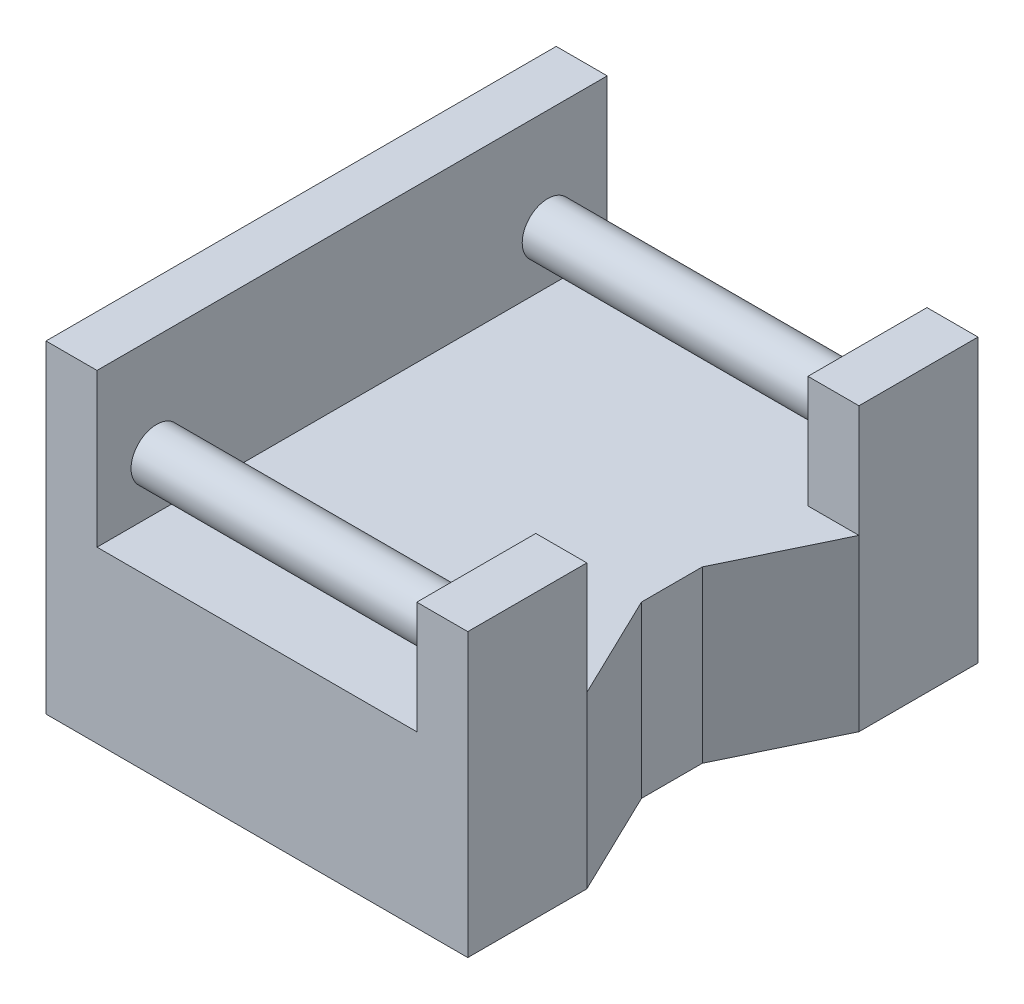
from build123d import *

# Parameters (mm, degrees)
ESTRUSIONE_ESTRUSIONE2_DEPTH = 5
SCHIZZO4_W                   = 1.5
SCHIZZO4_H                   = 15
ESTRUSIONE_ESTRUSIONE4_DEPTH = 4.5
SCHIZZO5_W                   = 1.5
SCHIZZO5_H                   = 3.5
ESTRUSIONE_ESTRUSIONE5_DEPTH = 3.3
SCHIZZO7_R                   = 0.75
ESTRUSIONE_ESTRUSIONE6_DEPTH = 10
SCALA2_SCALE                 = 10


with BuildPart() as part:
    # Schizzo1 → Estrusione-Estrusione2 (new body)
    with BuildSketch(Plane(origin=(0, 0, 0), x_dir=(1, 0, 0), z_dir=(0, 1, 0))):
        Polygon((0, 0), (0, 15), (12.4, 15), (12.4, 11.5), (10.9, 8.39340669), (10.9, 6.60659331), (12.4, 3.5), (12.4, 0), align=None)
    extrude(amount=ESTRUSIONE_ESTRUSIONE2_DEPTH)

    # Schizzo4 → Estrusione-Estrusione4 (add)
    with BuildSketch(Plane(origin=(0, 5, 0), x_dir=(1, 0, 0), z_dir=(0, 1, 0))):
        with Locations((0.75, 7.5)):
            Rectangle(SCHIZZO4_W, SCHIZZO4_H)
    extrude(amount=ESTRUSIONE_ESTRUSIONE4_DEPTH)

    # Schizzo5 → Estrusione-Estrusione5 (add)
    with BuildSketch(Plane(origin=(0, 5, 0), x_dir=(1, 0, 0), z_dir=(0, 1, 0))):
        with Locations((11.65, 1.75)):
            Rectangle(SCHIZZO5_W, SCHIZZO5_H)
        with Locations((11.65, 13.25)):
            Rectangle(SCHIZZO5_W, SCHIZZO5_H)
    extrude(amount=ESTRUSIONE_ESTRUSIONE5_DEPTH)

    # Schizzo7 → Estrusione-Estrusione6 (add)
    with BuildSketch(Plane.ZY.offset(-10.9)):
        with Locations(Location((-1.75, 6.5, 0), (0, 0, 180))):
            Circle(SCHIZZO7_R)
        with Locations(Location((-13.25, 6.5, 0), (0, 0, 180))):
            Circle(SCHIZZO7_R)
    extrude(amount=ESTRUSIONE_ESTRUSIONE6_DEPTH)


with BuildPart() as part_1:
    # Scala2: scaled about (5.66460731, 3.21311072, -7.5)
    add(part.part.scale(SCALA2_SCALE).moved(Location((-50.98146579, -28.91799648, 67.5))))


solid = part_1.part
